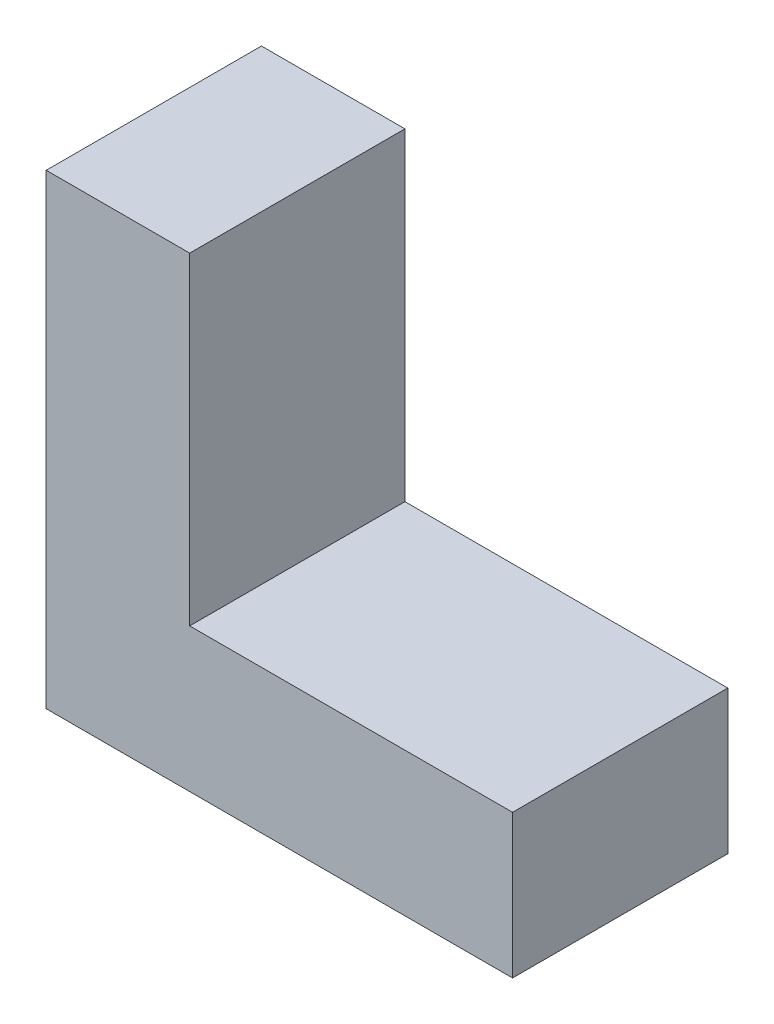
ISO-10303-21;
HEADER;
FILE_DESCRIPTION(('STEP AP214'),'2;1');
FILE_NAME('part.step','',(''),(''),'','','');
FILE_SCHEMA(('AUTOMOTIVE_DESIGN { 1 0 10303 214 1 1 1 1 }'));
ENDSEC;
DATA;
#1=APPLICATION_CONTEXT('core data for automotive mechanical design processes');
#2=APPLICATION_PROTOCOL_DEFINITION('international standard','automotive_design',2000,#1);
#3=PRODUCT_CONTEXT('',#1,'mechanical');
#4=PRODUCT('Part','Part','',(#3));
#5=PRODUCT_RELATED_PRODUCT_CATEGORY('part','',(#4));
#6=PRODUCT_DEFINITION_FORMATION('','',#4);
#7=PRODUCT_DEFINITION_CONTEXT('part definition',#1,'design');
#8=PRODUCT_DEFINITION('design','',#6,#7);
#9=PRODUCT_DEFINITION_SHAPE('','',#8);
#10=(LENGTH_UNIT() NAMED_UNIT(*) SI_UNIT(.MILLI.,.METRE.));
#11=(NAMED_UNIT(*) PLANE_ANGLE_UNIT() SI_UNIT($,.RADIAN.));
#12=(NAMED_UNIT(*) SI_UNIT($,.STERADIAN.) SOLID_ANGLE_UNIT());
#13=UNCERTAINTY_MEASURE_WITH_UNIT(LENGTH_MEASURE(1.E-05),#10,'distance_accuracy_value','');
#14=(GEOMETRIC_REPRESENTATION_CONTEXT(3) GLOBAL_UNCERTAINTY_ASSIGNED_CONTEXT((#13)) GLOBAL_UNIT_ASSIGNED_CONTEXT((#10,
#11,#12)) REPRESENTATION_CONTEXT('',''));
#15=CARTESIAN_POINT('',(0.,0.,0.));
#16=DIRECTION('',(0.,0.,1.));
#17=DIRECTION('',(1.,0.,0.));
#18=AXIS2_PLACEMENT_3D('',#15,#16,#17);
#19=CARTESIAN_POINT('',(0.,13.,6.));
#20=DIRECTION('',(1.,0.,0.));
#21=DIRECTION('',(0.,1.,0.));
#22=AXIS2_PLACEMENT_3D('',#19,#20,#21);
#23=PLANE('',#22);
#24=DIRECTION('',(0.,-1.,0.));
#25=VECTOR('',#24,1.);
#26=CARTESIAN_POINT('',(0.,13.,0.));
#27=LINE('',#26,#25);
#28=CARTESIAN_POINT('',(0.,13.,0.));
#29=VERTEX_POINT('',#28);
#30=CARTESIAN_POINT('',(0.,0.,0.));
#31=VERTEX_POINT('',#30);
#32=EDGE_CURVE('E115',#29,#31,#27,.T.);
#33=ORIENTED_EDGE('',*,*,#32,.T.);
#34=DIRECTION('',(0.,0.,-1.));
#35=VECTOR('',#34,1.);
#36=CARTESIAN_POINT('',(0.,0.,6.));
#37=LINE('',#36,#35);
#38=CARTESIAN_POINT('',(0.,0.,6.));
#39=VERTEX_POINT('',#38);
#40=EDGE_CURVE('E11',#39,#31,#37,.T.);
#41=ORIENTED_EDGE('',*,*,#40,.F.);
#42=DIRECTION('',(0.,-1.,0.));
#43=VECTOR('',#42,1.);
#44=CARTESIAN_POINT('',(0.,13.,6.));
#45=LINE('',#44,#43);
#46=CARTESIAN_POINT('',(0.,13.,6.));
#47=VERTEX_POINT('',#46);
#48=EDGE_CURVE('E125',#47,#39,#45,.T.);
#49=ORIENTED_EDGE('',*,*,#48,.F.);
#50=DIRECTION('',(0.,0.,-1.));
#51=VECTOR('',#50,1.);
#52=CARTESIAN_POINT('',(0.,13.,6.));
#53=LINE('',#52,#51);
#54=EDGE_CURVE('E111',#47,#29,#53,.T.);
#55=ORIENTED_EDGE('',*,*,#54,.T.);
#56=EDGE_LOOP('',(#33,#41,#49,#55));
#57=FACE_BOUND('',#56,.T.);
#58=ADVANCED_FACE('F31',(#57),#23,.F.);
#59=CARTESIAN_POINT('',(0.,0.,6.));
#60=DIRECTION('',(0.,1.,0.));
#61=DIRECTION('',(0.,0.,1.));
#62=AXIS2_PLACEMENT_3D('',#59,#60,#61);
#63=PLANE('',#62);
#64=DIRECTION('',(1.,0.,0.));
#65=VECTOR('',#64,1.);
#66=CARTESIAN_POINT('',(0.,0.,0.));
#67=LINE('',#66,#65);
#68=CARTESIAN_POINT('',(13.,0.,0.));
#69=VERTEX_POINT('',#68);
#70=EDGE_CURVE('E118',#31,#69,#67,.T.);
#71=ORIENTED_EDGE('',*,*,#70,.T.);
#72=DIRECTION('',(0.,0.,-1.));
#73=VECTOR('',#72,1.);
#74=CARTESIAN_POINT('',(13.,0.,6.));
#75=LINE('',#74,#73);
#76=CARTESIAN_POINT('',(13.,0.,6.));
#77=VERTEX_POINT('',#76);
#78=EDGE_CURVE('E39',#77,#69,#75,.T.);
#79=ORIENTED_EDGE('',*,*,#78,.F.);
#80=DIRECTION('',(1.,0.,0.));
#81=VECTOR('',#80,1.);
#82=CARTESIAN_POINT('',(0.,0.,6.));
#83=LINE('',#82,#81);
#84=EDGE_CURVE('E84',#39,#77,#83,.T.);
#85=ORIENTED_EDGE('',*,*,#84,.F.);
#86=ORIENTED_EDGE('',*,*,#40,.T.);
#87=EDGE_LOOP('',(#71,#79,#85,#86));
#88=FACE_BOUND('',#87,.T.);
#89=ADVANCED_FACE('F149',(#88),#63,.F.);
#90=CARTESIAN_POINT('',(13.,0.,6.));
#91=DIRECTION('',(-1.,0.,0.));
#92=DIRECTION('',(0.,0.,1.));
#93=AXIS2_PLACEMENT_3D('',#90,#91,#92);
#94=PLANE('',#93);
#95=DIRECTION('',(0.,1.,0.));
#96=VECTOR('',#95,1.);
#97=CARTESIAN_POINT('',(13.,0.,0.));
#98=LINE('',#97,#96);
#99=CARTESIAN_POINT('',(13.,4.,0.));
#100=VERTEX_POINT('',#99);
#101=EDGE_CURVE('E120',#69,#100,#98,.T.);
#102=ORIENTED_EDGE('',*,*,#101,.T.);
#103=DIRECTION('',(0.,0.,-1.));
#104=VECTOR('',#103,1.);
#105=CARTESIAN_POINT('',(13.,4.,6.));
#106=LINE('',#105,#104);
#107=CARTESIAN_POINT('',(13.,4.,6.));
#108=VERTEX_POINT('',#107);
#109=EDGE_CURVE('E106',#108,#100,#106,.T.);
#110=ORIENTED_EDGE('',*,*,#109,.F.);
#111=DIRECTION('',(0.,1.,0.));
#112=VECTOR('',#111,1.);
#113=CARTESIAN_POINT('',(13.,0.,6.));
#114=LINE('',#113,#112);
#115=EDGE_CURVE('E97',#77,#108,#114,.T.);
#116=ORIENTED_EDGE('',*,*,#115,.F.);
#117=ORIENTED_EDGE('',*,*,#78,.T.);
#118=EDGE_LOOP('',(#102,#110,#116,#117));
#119=FACE_BOUND('',#118,.T.);
#120=ADVANCED_FACE('F131',(#119),#94,.F.);
#121=CARTESIAN_POINT('',(13.,4.,6.));
#122=DIRECTION('',(0.,-1.,0.));
#123=DIRECTION('',(1.,0.,0.));
#124=AXIS2_PLACEMENT_3D('',#121,#122,#123);
#125=PLANE('',#124);
#126=DIRECTION('',(-1.,0.,0.));
#127=VECTOR('',#126,1.);
#128=CARTESIAN_POINT('',(13.,4.,0.));
#129=LINE('',#128,#127);
#130=CARTESIAN_POINT('',(4.,4.,0.));
#131=VERTEX_POINT('',#130);
#132=EDGE_CURVE('E105',#100,#131,#129,.T.);
#133=ORIENTED_EDGE('',*,*,#132,.T.);
#134=DIRECTION('',(0.,0.,-1.));
#135=VECTOR('',#134,1.);
#136=CARTESIAN_POINT('',(4.,4.,6.));
#137=LINE('',#136,#135);
#138=CARTESIAN_POINT('',(4.,4.,6.));
#139=VERTEX_POINT('',#138);
#140=EDGE_CURVE('E102',#139,#131,#137,.T.);
#141=ORIENTED_EDGE('',*,*,#140,.F.);
#142=DIRECTION('',(-1.,0.,0.));
#143=VECTOR('',#142,1.);
#144=CARTESIAN_POINT('',(13.,4.,6.));
#145=LINE('',#144,#143);
#146=EDGE_CURVE('E91',#108,#139,#145,.T.);
#147=ORIENTED_EDGE('',*,*,#146,.F.);
#148=ORIENTED_EDGE('',*,*,#109,.T.);
#149=EDGE_LOOP('',(#133,#141,#147,#148));
#150=FACE_BOUND('',#149,.T.);
#151=ADVANCED_FACE('F103',(#150),#125,.F.);
#152=CARTESIAN_POINT('',(4.,4.,6.));
#153=DIRECTION('',(-1.,0.,0.));
#154=DIRECTION('',(0.,0.,1.));
#155=AXIS2_PLACEMENT_3D('',#152,#153,#154);
#156=PLANE('',#155);
#157=DIRECTION('',(0.,1.,0.));
#158=VECTOR('',#157,1.);
#159=CARTESIAN_POINT('',(4.,4.,0.));
#160=LINE('',#159,#158);
#161=CARTESIAN_POINT('',(4.,13.,0.));
#162=VERTEX_POINT('',#161);
#163=EDGE_CURVE('E70',#131,#162,#160,.T.);
#164=ORIENTED_EDGE('',*,*,#163,.T.);
#165=DIRECTION('',(0.,0.,-1.));
#166=VECTOR('',#165,1.);
#167=CARTESIAN_POINT('',(4.,13.,6.));
#168=LINE('',#167,#166);
#169=CARTESIAN_POINT('',(4.,13.,6.));
#170=VERTEX_POINT('',#169);
#171=EDGE_CURVE('E107',#170,#162,#168,.T.);
#172=ORIENTED_EDGE('',*,*,#171,.F.);
#173=DIRECTION('',(0.,1.,0.));
#174=VECTOR('',#173,1.);
#175=CARTESIAN_POINT('',(4.,4.,6.));
#176=LINE('',#175,#174);
#177=EDGE_CURVE('E95',#139,#170,#176,.T.);
#178=ORIENTED_EDGE('',*,*,#177,.F.);
#179=ORIENTED_EDGE('',*,*,#140,.T.);
#180=EDGE_LOOP('',(#164,#172,#178,#179));
#181=FACE_BOUND('',#180,.T.);
#182=ADVANCED_FACE('F109',(#181),#156,.F.);
#183=CARTESIAN_POINT('',(4.,13.,6.));
#184=DIRECTION('',(0.,-1.,0.));
#185=DIRECTION('',(1.,0.,0.));
#186=AXIS2_PLACEMENT_3D('',#183,#184,#185);
#187=PLANE('',#186);
#188=DIRECTION('',(-1.,0.,0.));
#189=VECTOR('',#188,1.);
#190=CARTESIAN_POINT('',(4.,13.,0.));
#191=LINE('',#190,#189);
#192=EDGE_CURVE('E76',#162,#29,#191,.T.);
#193=ORIENTED_EDGE('',*,*,#192,.T.);
#194=ORIENTED_EDGE('',*,*,#54,.F.);
#195=DIRECTION('',(-1.,0.,0.));
#196=VECTOR('',#195,1.);
#197=CARTESIAN_POINT('',(4.,13.,6.));
#198=LINE('',#197,#196);
#199=EDGE_CURVE('E47',#170,#47,#198,.T.);
#200=ORIENTED_EDGE('',*,*,#199,.F.);
#201=ORIENTED_EDGE('',*,*,#171,.T.);
#202=EDGE_LOOP('',(#193,#194,#200,#201));
#203=FACE_BOUND('',#202,.T.);
#204=ADVANCED_FACE('F138',(#203),#187,.F.);
#205=CARTESIAN_POINT('',(0.,0.,6.));
#206=DIRECTION('',(0.,0.,1.));
#207=DIRECTION('',(1.,0.,0.));
#208=AXIS2_PLACEMENT_3D('',#205,#206,#207);
#209=PLANE('',#208);
#210=ORIENTED_EDGE('',*,*,#48,.T.);
#211=ORIENTED_EDGE('',*,*,#84,.T.);
#212=ORIENTED_EDGE('',*,*,#115,.T.);
#213=ORIENTED_EDGE('',*,*,#146,.T.);
#214=ORIENTED_EDGE('',*,*,#177,.T.);
#215=ORIENTED_EDGE('',*,*,#199,.T.);
#216=EDGE_LOOP('',(#210,#211,#212,#213,#214,#215));
#217=FACE_BOUND('',#216,.T.);
#218=ADVANCED_FACE('F93',(#217),#209,.T.);
#219=CARTESIAN_POINT('',(0.,0.,0.));
#220=DIRECTION('',(0.,0.,1.));
#221=DIRECTION('',(1.,0.,0.));
#222=AXIS2_PLACEMENT_3D('',#219,#220,#221);
#223=PLANE('',#222);
#224=ORIENTED_EDGE('',*,*,#32,.F.);
#225=ORIENTED_EDGE('',*,*,#192,.F.);
#226=ORIENTED_EDGE('',*,*,#163,.F.);
#227=ORIENTED_EDGE('',*,*,#132,.F.);
#228=ORIENTED_EDGE('',*,*,#101,.F.);
#229=ORIENTED_EDGE('',*,*,#70,.F.);
#230=EDGE_LOOP('',(#224,#225,#226,#227,#228,#229));
#231=FACE_BOUND('',#230,.T.);
#232=ADVANCED_FACE('F134',(#231),#223,.F.);
#233=CLOSED_SHELL('',(#58,#89,#120,#151,#182,#204,#218,#232));
#234=MANIFOLD_SOLID_BREP('B2',#233);
#235=ADVANCED_BREP_SHAPE_REPRESENTATION('',(#18,#234),#14);
#236=SHAPE_DEFINITION_REPRESENTATION(#9,#235);
ENDSEC;
END-ISO-10303-21;
